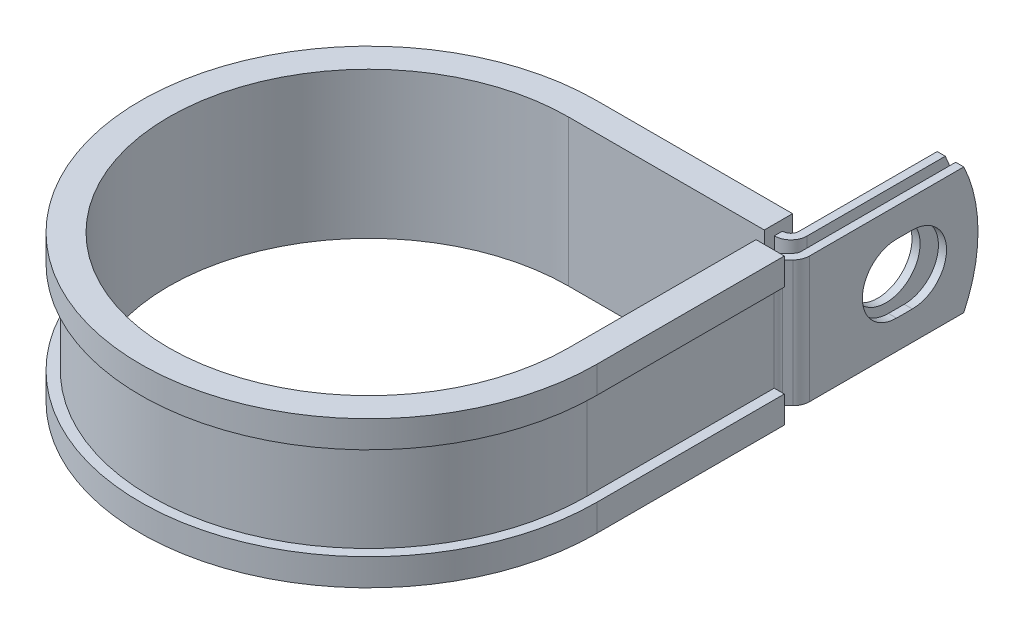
from build123d import *

# Parameters (mm, degrees)
EXTRUDE_THIN1_DEPTH = 9.525
SKETCH2_R           = 5.1562
CUT_EXTRUDE1_DEPTH  = 1.2192
CUT_EXTRUDE2_DEPTH  = 1.2192
CUT_EXTRUDE3_DEPTH  = 87.087652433


with BuildPart() as part:
    # Sketch1 → Extrude-Thin1 (new, symmetric)
    with BuildSketch(Plane(origin=(0, 0, 0), x_dir=(1, 0, 0), z_dir=(0, 1, 0))):
        with BuildLine():
            Line((33.5839698, 57.1246), (33.5839698, 31.6865))
            ThreePointArc((33.5839698, 31.6865), (33.491163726, 31.219932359), (33.226874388, 30.824395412))
            Line((33.226874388, 30.824395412), (32.400690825, 29.998211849))
            ThreePointArc((32.400690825, 29.998211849), (31.872112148, 29.207137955), (31.6865, 28.274002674))
            Line((31.6865, 28.274002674), (31.6865, 0))
            ThreePointArc((31.6865, 0), (-22.405739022, -22.405739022), (0, 31.6865))
            Line((0, 31.6865), (29.5707698, 31.6865))
            ThreePointArc((29.5707698, 31.6865), (31.294978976, 32.400690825), (32.0091698, 34.1249))
            Line((32.0091698, 34.1249), (32.0091698, 57.1246))
            Line((32.0091698, 57.1246), (30.7899698, 57.1246))
            Line((30.7899698, 57.1246), (30.7899698, 34.1249))
            ThreePointArc((30.7899698, 34.1249), (30.432874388, 33.262795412), (29.5707698, 32.9057))
            Line((29.5707698, 32.9057), (0, 32.9057))
            ThreePointArc((0, 32.9057), (-23.26784361, -23.26784361), (32.9057, 0))
            Line((32.9057, 0), (32.9057, 28.274002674))
            ThreePointArc((32.9057, 28.274002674), (32.998506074, 28.740570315), (33.262795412, 29.136107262))
            Line((33.262795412, 29.136107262), (34.088978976, 29.962290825))
            ThreePointArc((34.088978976, 29.962290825), (34.617557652, 30.753364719), (34.8031698, 31.6865))
            Line((34.8031698, 31.6865), (34.8031698, 57.1246))
            Line((34.8031698, 57.1246), (33.5839698, 57.1246))
        make_face()
    extrude(amount=EXTRUDE_THIN1_DEPTH, both=True)

    # Sketch2 → Cut-Extrude1 (cut)
    with BuildSketch(Plane.ZY.offset(-30.7899698)):
        with Locations((-46.0248, 0)):
            Circle(SKETCH2_R)
    extrude(amount=-CUT_EXTRUDE1_DEPTH, mode=Mode.SUBTRACT)

    # Sketch3 → Cut-Extrude2 (cut)
    with BuildSketch(Plane(origin=(34.8031698, 0, 0), x_dir=(0, 0, -1), z_dir=(1, 0, 0))):
        with BuildLine():
            Line((44.831, 5.1562), (47.2186, 5.1562))
            ThreePointArc((47.2186, 5.1562), (52.3748, 0), (47.2186, -5.1562))
            Line((47.2186, -5.1562), (44.831, -5.1562))
            ThreePointArc((44.831, -5.1562), (39.6748, 0), (44.831, 5.1562))
        make_face()
    extrude(amount=-CUT_EXTRUDE2_DEPTH, mode=Mode.SUBTRACT)

    # Sketch4 → Cut-Extrude3 (cut, through all)
    with BuildSketch(Plane.ZY.offset(-30.7899698)):
        with BuildLine():
            Line((-54.980063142, 9.525), (-57.1246, 9.525))
            Line((-57.1246, 9.525), (-57.1246, 0))
            ThreePointArc((-57.1246, 0), (-56.581838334, 4.881717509), (-54.980063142, 9.525))
        make_face()
        with BuildLine():
            ThreePointArc((-54.980063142, -9.525), (-56.581838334, -4.881717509), (-57.1246, 0))
            Line((-57.1246, 0), (-57.1246, -9.525))
            Line((-57.1246, -9.525), (-54.980063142, -9.525))
        make_face()
    extrude(amount=-CUT_EXTRUDE3_DEPTH, mode=Mode.SUBTRACT)

    # Sweep1: sweep along a path in Sketch6
    with BuildLine(Plane(origin=(0, 9.525, 0), x_dir=(1, 0, 0), z_dir=(0, 1, 0))) as sweep1_path:
        Line((30.1625, 28.274002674), (30.1625, 0))
        ThreePointArc((30.1625, 0), (-21.328108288, -21.328108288), (0, 30.1625))
        Line((0, 30.1625), (29.5199698, 30.1625))
    # Sketch5 → Sweep1 (sweep)
    with BuildSketch(Plane(origin=(0, 0, -28.274002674), x_dir=(-1, 0, 0), z_dir=(0, 0, -1))):
        Polygon((-32.9057, 9.525), (-31.6865, 9.525), (-31.6865, -9.525), (-32.9057, -9.525), (-32.9057, -6.985), (-34.4297, -6.985), (-34.4297, -11.049), (-30.1625, -11.049), (-30.1625, 11.049), (-34.4297, 11.049), (-34.4297, 6.985), (-32.9057, 6.985), align=None)
    sweep(path=sweep1_path.line)


solid = part.part
